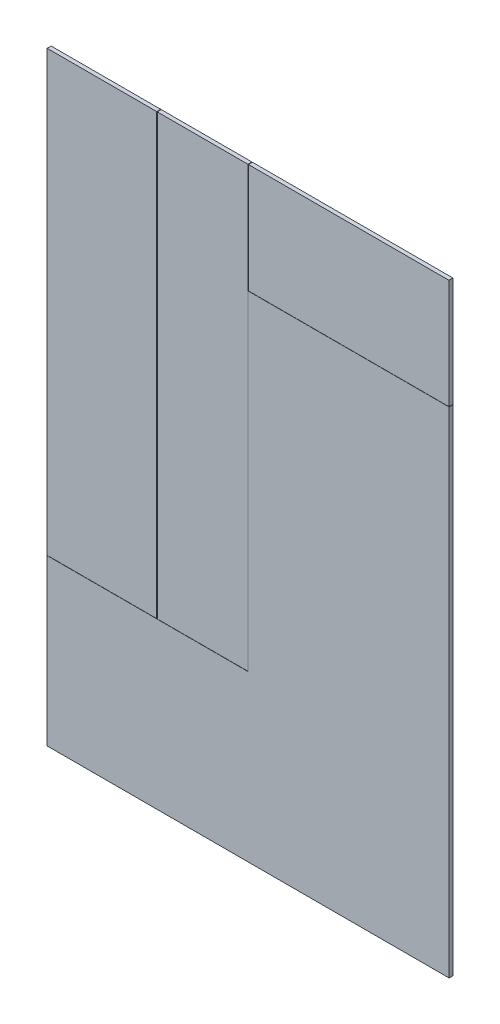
ISO-10303-21;
HEADER;
FILE_DESCRIPTION(('STEP AP214'),'2;1');
FILE_NAME('part.step','',(''),(''),'','','');
FILE_SCHEMA(('AUTOMOTIVE_DESIGN { 1 0 10303 214 1 1 1 1 }'));
ENDSEC;
DATA;
#1=APPLICATION_CONTEXT('core data for automotive mechanical design processes');
#2=APPLICATION_PROTOCOL_DEFINITION('international standard','automotive_design',2000,#1);
#3=PRODUCT_CONTEXT('',#1,'mechanical');
#4=PRODUCT('Part','Part','',(#3));
#5=PRODUCT_RELATED_PRODUCT_CATEGORY('part','',(#4));
#6=PRODUCT_DEFINITION_FORMATION('','',#4);
#7=PRODUCT_DEFINITION_CONTEXT('part definition',#1,'design');
#8=PRODUCT_DEFINITION('design','',#6,#7);
#9=PRODUCT_DEFINITION_SHAPE('','',#8);
#10=(LENGTH_UNIT() NAMED_UNIT(*) SI_UNIT(.MILLI.,.METRE.));
#11=(NAMED_UNIT(*) PLANE_ANGLE_UNIT() SI_UNIT($,.RADIAN.));
#12=(NAMED_UNIT(*) SI_UNIT($,.STERADIAN.) SOLID_ANGLE_UNIT());
#13=UNCERTAINTY_MEASURE_WITH_UNIT(LENGTH_MEASURE(1.E-05),#10,'distance_accuracy_value','');
#14=(GEOMETRIC_REPRESENTATION_CONTEXT(3) GLOBAL_UNCERTAINTY_ASSIGNED_CONTEXT((#13)) GLOBAL_UNIT_ASSIGNED_CONTEXT((#10,
#11,#12)) REPRESENTATION_CONTEXT('',''));
#15=CARTESIAN_POINT('',(0.,0.,0.));
#16=DIRECTION('',(0.,0.,1.));
#17=DIRECTION('',(1.,0.,0.));
#18=AXIS2_PLACEMENT_3D('',#15,#16,#17);
#19=CARTESIAN_POINT('',(0.,2750.,18.));
#20=DIRECTION('',(0.,-1.,0.));
#21=DIRECTION('',(1.,0.,0.));
#22=AXIS2_PLACEMENT_3D('',#19,#20,#21);
#23=PLANE('',#22);
#24=DIRECTION('',(-1.,0.,0.));
#25=VECTOR('',#24,1.);
#26=CARTESIAN_POINT('',(0.,2750.,0.));
#27=LINE('',#26,#25);
#28=CARTESIAN_POINT('',(-1328.99999999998,2750.,0.));
#29=VERTEX_POINT('',#28);
#30=CARTESIAN_POINT('',(-1329.99999999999,2750.,0.));
#31=VERTEX_POINT('',#30);
#32=EDGE_CURVE('E177',#29,#31,#27,.T.);
#33=ORIENTED_EDGE('',*,*,#32,.T.);
#34=DIRECTION('',(0.,0.,1.));
#35=VECTOR('',#34,1.);
#36=CARTESIAN_POINT('',(-1329.99999999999,2750.,0.));
#37=LINE('',#36,#35);
#38=CARTESIAN_POINT('',(-1329.99999999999,2750.,18.));
#39=VERTEX_POINT('',#38);
#40=EDGE_CURVE('E172',#31,#39,#37,.T.);
#41=ORIENTED_EDGE('',*,*,#40,.T.);
#42=DIRECTION('',(-1.,0.,0.));
#43=VECTOR('',#42,1.);
#44=CARTESIAN_POINT('',(0.,2750.,18.));
#45=LINE('',#44,#43);
#46=CARTESIAN_POINT('',(-1328.99999999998,2750.,18.));
#47=VERTEX_POINT('',#46);
#48=EDGE_CURVE('E162',#47,#39,#45,.T.);
#49=ORIENTED_EDGE('',*,*,#48,.F.);
#50=DIRECTION('',(0.,0.,1.));
#51=VECTOR('',#50,1.);
#52=CARTESIAN_POINT('',(-1328.99999999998,2750.,0.));
#53=LINE('',#52,#51);
#54=EDGE_CURVE('E213',#29,#47,#53,.T.);
#55=ORIENTED_EDGE('',*,*,#54,.F.);
#56=EDGE_LOOP('',(#33,#41,#49,#55));
#57=FACE_BOUND('',#56,.T.);
#58=ADVANCED_FACE('F43',(#57),#23,.F.);
#59=CARTESIAN_POINT('',(0.,0.,18.));
#60=DIRECTION('',(-1.,0.,0.));
#61=DIRECTION('',(0.,0.,1.));
#62=AXIS2_PLACEMENT_3D('',#59,#60,#61);
#63=PLANE('',#62);
#64=DIRECTION('',(0.,1.,0.));
#65=VECTOR('',#64,1.);
#66=CARTESIAN_POINT('',(0.,0.,0.));
#67=LINE('',#66,#65);
#68=CARTESIAN_POINT('',(0.,0.,0.));
#69=VERTEX_POINT('',#68);
#70=CARTESIAN_POINT('',(0.,2250.,0.));
#71=VERTEX_POINT('',#70);
#72=EDGE_CURVE('E154',#69,#71,#67,.T.);
#73=ORIENTED_EDGE('',*,*,#72,.T.);
#74=DIRECTION('',(0.,0.,1.));
#75=VECTOR('',#74,1.);
#76=CARTESIAN_POINT('',(0.,2250.,0.));
#77=LINE('',#76,#75);
#78=CARTESIAN_POINT('',(0.,2250.,18.));
#79=VERTEX_POINT('',#78);
#80=EDGE_CURVE('E142',#71,#79,#77,.T.);
#81=ORIENTED_EDGE('',*,*,#80,.T.);
#82=DIRECTION('',(0.,1.,0.));
#83=VECTOR('',#82,1.);
#84=CARTESIAN_POINT('',(0.,0.,18.));
#85=LINE('',#84,#83);
#86=CARTESIAN_POINT('',(0.,0.,18.));
#87=VERTEX_POINT('',#86);
#88=EDGE_CURVE('E152',#87,#79,#85,.T.);
#89=ORIENTED_EDGE('',*,*,#88,.F.);
#90=DIRECTION('',(0.,0.,-1.));
#91=VECTOR('',#90,1.);
#92=CARTESIAN_POINT('',(0.,0.,18.));
#93=LINE('',#92,#91);
#94=EDGE_CURVE('E155',#87,#69,#93,.T.);
#95=ORIENTED_EDGE('',*,*,#94,.T.);
#96=EDGE_LOOP('',(#73,#81,#89,#95));
#97=FACE_BOUND('',#96,.T.);
#98=ADVANCED_FACE('F150',(#97),#63,.F.);
#99=CARTESIAN_POINT('',(-913.999999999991,2750.,18.));
#100=VERTEX_POINT('',#99);
#101=CARTESIAN_POINT('',(-914.999999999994,2750.,18.));
#102=VERTEX_POINT('',#101);
#103=EDGE_CURVE('E160',#100,#102,#45,.T.);
#104=ORIENTED_EDGE('',*,*,#103,.F.);
#105=DIRECTION('',(0.,0.,1.));
#106=VECTOR('',#105,1.);
#107=CARTESIAN_POINT('',(-913.999999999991,2750.,0.));
#108=LINE('',#107,#106);
#109=CARTESIAN_POINT('',(-913.999999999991,2750.,0.));
#110=VERTEX_POINT('',#109);
#111=EDGE_CURVE('E136',#110,#100,#108,.T.);
#112=ORIENTED_EDGE('',*,*,#111,.F.);
#113=CARTESIAN_POINT('',(-914.999999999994,2750.,0.));
#114=VERTEX_POINT('',#113);
#115=EDGE_CURVE('E173',#110,#114,#27,.T.);
#116=ORIENTED_EDGE('',*,*,#115,.T.);
#117=DIRECTION('',(0.,0.,1.));
#118=VECTOR('',#117,1.);
#119=CARTESIAN_POINT('',(-914.999999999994,2750.,0.));
#120=LINE('',#119,#118);
#121=EDGE_CURVE('E176',#114,#102,#120,.T.);
#122=ORIENTED_EDGE('',*,*,#121,.T.);
#123=EDGE_LOOP('',(#104,#112,#116,#122));
#124=FACE_BOUND('',#123,.T.);
#125=ADVANCED_FACE('F230',(#124),#23,.F.);
#126=CARTESIAN_POINT('',(-1830.,-2.24110364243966E-13,18.));
#127=DIRECTION('',(1.,0.,0.));
#128=DIRECTION('',(0.,0.,-1.));
#129=AXIS2_PLACEMENT_3D('',#126,#127,#128);
#130=PLANE('',#129);
#131=DIRECTION('',(0.,-1.,0.));
#132=VECTOR('',#131,1.);
#133=CARTESIAN_POINT('',(-1830.,-2.24110364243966E-13,18.));
#134=LINE('',#133,#132);
#135=CARTESIAN_POINT('',(-1830.,750.,18.));
#136=VERTEX_POINT('',#135);
#137=CARTESIAN_POINT('',(-1830.,-2.24110364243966E-13,18.));
#138=VERTEX_POINT('',#137);
#139=EDGE_CURVE('E164',#136,#138,#134,.T.);
#140=ORIENTED_EDGE('',*,*,#139,.F.);
#141=DIRECTION('',(0.,0.,1.));
#142=VECTOR('',#141,1.);
#143=CARTESIAN_POINT('',(-1830.,750.,0.));
#144=LINE('',#143,#142);
#145=CARTESIAN_POINT('',(-1830.,750.,0.));
#146=VERTEX_POINT('',#145);
#147=EDGE_CURVE('E12',#146,#136,#144,.T.);
#148=ORIENTED_EDGE('',*,*,#147,.F.);
#149=DIRECTION('',(0.,-1.,0.));
#150=VECTOR('',#149,1.);
#151=CARTESIAN_POINT('',(-1830.,-2.24110364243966E-13,0.));
#152=LINE('',#151,#150);
#153=CARTESIAN_POINT('',(-1830.,-2.24110364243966E-13,0.));
#154=VERTEX_POINT('',#153);
#155=EDGE_CURVE('E178',#146,#154,#152,.T.);
#156=ORIENTED_EDGE('',*,*,#155,.T.);
#157=DIRECTION('',(0.,0.,-1.));
#158=VECTOR('',#157,1.);
#159=CARTESIAN_POINT('',(-1830.,-2.24110364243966E-13,18.));
#160=LINE('',#159,#158);
#161=EDGE_CURVE('E169',#138,#154,#160,.T.);
#162=ORIENTED_EDGE('',*,*,#161,.F.);
#163=EDGE_LOOP('',(#140,#148,#156,#162));
#164=FACE_BOUND('',#163,.T.);
#165=ADVANCED_FACE('F267',(#164),#130,.F.);
#166=CARTESIAN_POINT('',(0.,0.,18.));
#167=DIRECTION('',(0.,1.,0.));
#168=DIRECTION('',(-1.,0.,0.));
#169=AXIS2_PLACEMENT_3D('',#166,#167,#168);
#170=PLANE('',#169);
#171=DIRECTION('',(1.,0.,0.));
#172=VECTOR('',#171,1.);
#173=CARTESIAN_POINT('',(0.,0.,0.));
#174=LINE('',#173,#172);
#175=EDGE_CURVE('E180',#154,#69,#174,.T.);
#176=ORIENTED_EDGE('',*,*,#175,.T.);
#177=ORIENTED_EDGE('',*,*,#94,.F.);
#178=DIRECTION('',(1.,0.,0.));
#179=VECTOR('',#178,1.);
#180=CARTESIAN_POINT('',(0.,0.,18.));
#181=LINE('',#180,#179);
#182=EDGE_CURVE('E158',#138,#87,#181,.T.);
#183=ORIENTED_EDGE('',*,*,#182,.F.);
#184=ORIENTED_EDGE('',*,*,#161,.T.);
#185=EDGE_LOOP('',(#176,#177,#183,#184));
#186=FACE_BOUND('',#185,.T.);
#187=ADVANCED_FACE('F271',(#186),#170,.F.);
#188=CARTESIAN_POINT('',(0.,0.,18.));
#189=DIRECTION('',(0.,0.,1.));
#190=DIRECTION('',(1.,0.,0.));
#191=AXIS2_PLACEMENT_3D('',#188,#189,#190);
#192=PLANE('',#191);
#193=DIRECTION('',(0.,1.,0.));
#194=VECTOR('',#193,1.);
#195=CARTESIAN_POINT('',(-1329.99999999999,2750.,18.));
#196=LINE('',#195,#194);
#197=CARTESIAN_POINT('',(-1329.99999999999,750.,18.));
#198=VERTEX_POINT('',#197);
#199=EDGE_CURVE('E73',#198,#39,#196,.T.);
#200=ORIENTED_EDGE('',*,*,#199,.F.);
#201=DIRECTION('',(1.,0.,0.));
#202=VECTOR('',#201,1.);
#203=CARTESIAN_POINT('',(-1830.,750.,18.));
#204=LINE('',#203,#202);
#205=EDGE_CURVE('E53',#136,#198,#204,.T.);
#206=ORIENTED_EDGE('',*,*,#205,.F.);
#207=ORIENTED_EDGE('',*,*,#139,.T.);
#208=ORIENTED_EDGE('',*,*,#182,.T.);
#209=ORIENTED_EDGE('',*,*,#88,.T.);
#210=DIRECTION('',(1.,0.,0.));
#211=VECTOR('',#210,1.);
#212=CARTESIAN_POINT('',(-913.999999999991,2250.,18.));
#213=LINE('',#212,#211);
#214=CARTESIAN_POINT('',(-913.999999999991,2250.,18.));
#215=VERTEX_POINT('',#214);
#216=EDGE_CURVE('E139',#215,#79,#213,.T.);
#217=ORIENTED_EDGE('',*,*,#216,.F.);
#218=DIRECTION('',(0.,-1.,0.));
#219=VECTOR('',#218,1.);
#220=CARTESIAN_POINT('',(-913.999999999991,2750.,18.));
#221=LINE('',#220,#219);
#222=EDGE_CURVE('E186',#100,#215,#221,.T.);
#223=ORIENTED_EDGE('',*,*,#222,.F.);
#224=ORIENTED_EDGE('',*,*,#103,.T.);
#225=DIRECTION('',(0.,1.,0.));
#226=VECTOR('',#225,1.);
#227=CARTESIAN_POINT('',(-914.999999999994,2750.,18.));
#228=LINE('',#227,#226);
#229=CARTESIAN_POINT('',(-914.999999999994,750.,18.));
#230=VERTEX_POINT('',#229);
#231=EDGE_CURVE('E237',#230,#102,#228,.T.);
#232=ORIENTED_EDGE('',*,*,#231,.F.);
#233=DIRECTION('',(1.,0.,0.));
#234=VECTOR('',#233,1.);
#235=CARTESIAN_POINT('',(-1328.99999999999,750.,18.));
#236=LINE('',#235,#234);
#237=CARTESIAN_POINT('',(-1328.99999999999,750.,18.));
#238=VERTEX_POINT('',#237);
#239=EDGE_CURVE('E245',#238,#230,#236,.T.);
#240=ORIENTED_EDGE('',*,*,#239,.F.);
#241=DIRECTION('',(0.,-1.,0.));
#242=VECTOR('',#241,1.);
#243=CARTESIAN_POINT('',(-1328.99999999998,2750.,18.));
#244=LINE('',#243,#242);
#245=EDGE_CURVE('E191',#47,#238,#244,.T.);
#246=ORIENTED_EDGE('',*,*,#245,.F.);
#247=ORIENTED_EDGE('',*,*,#48,.T.);
#248=EDGE_LOOP('',(#200,#206,#207,#208,#209,#217,#223,#224,#232,#240,#246,#247));
#249=FACE_BOUND('',#248,.T.);
#250=ADVANCED_FACE('F45',(#249),#192,.T.);
#251=CARTESIAN_POINT('',(0.,0.,0.));
#252=DIRECTION('',(0.,0.,1.));
#253=DIRECTION('',(1.,0.,0.));
#254=AXIS2_PLACEMENT_3D('',#251,#252,#253);
#255=PLANE('',#254);
#256=DIRECTION('',(1.,0.,0.));
#257=VECTOR('',#256,1.);
#258=CARTESIAN_POINT('',(-1830.,750.,0.));
#259=LINE('',#258,#257);
#260=CARTESIAN_POINT('',(-1329.99999999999,750.,0.));
#261=VERTEX_POINT('',#260);
#262=EDGE_CURVE('E200',#146,#261,#259,.T.);
#263=ORIENTED_EDGE('',*,*,#262,.T.);
#264=DIRECTION('',(0.,1.,0.));
#265=VECTOR('',#264,1.);
#266=CARTESIAN_POINT('',(-1329.99999999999,2750.,0.));
#267=LINE('',#266,#265);
#268=EDGE_CURVE('E47',#261,#31,#267,.T.);
#269=ORIENTED_EDGE('',*,*,#268,.T.);
#270=ORIENTED_EDGE('',*,*,#32,.F.);
#271=DIRECTION('',(0.,-1.,0.));
#272=VECTOR('',#271,1.);
#273=CARTESIAN_POINT('',(-1328.99999999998,2750.,0.));
#274=LINE('',#273,#272);
#275=CARTESIAN_POINT('',(-1328.99999999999,750.,0.));
#276=VERTEX_POINT('',#275);
#277=EDGE_CURVE('E205',#29,#276,#274,.T.);
#278=ORIENTED_EDGE('',*,*,#277,.T.);
#279=DIRECTION('',(1.,0.,0.));
#280=VECTOR('',#279,1.);
#281=CARTESIAN_POINT('',(-1328.99999999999,750.,0.));
#282=LINE('',#281,#280);
#283=CARTESIAN_POINT('',(-914.999999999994,750.,0.));
#284=VERTEX_POINT('',#283);
#285=EDGE_CURVE('E239',#276,#284,#282,.T.);
#286=ORIENTED_EDGE('',*,*,#285,.T.);
#287=DIRECTION('',(0.,1.,0.));
#288=VECTOR('',#287,1.);
#289=CARTESIAN_POINT('',(-914.999999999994,2750.,0.));
#290=LINE('',#289,#288);
#291=EDGE_CURVE('E195',#284,#114,#290,.T.);
#292=ORIENTED_EDGE('',*,*,#291,.T.);
#293=ORIENTED_EDGE('',*,*,#115,.F.);
#294=DIRECTION('',(0.,-1.,0.));
#295=VECTOR('',#294,1.);
#296=CARTESIAN_POINT('',(-913.999999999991,2750.,0.));
#297=LINE('',#296,#295);
#298=CARTESIAN_POINT('',(-913.999999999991,2250.,0.));
#299=VERTEX_POINT('',#298);
#300=EDGE_CURVE('E192',#110,#299,#297,.T.);
#301=ORIENTED_EDGE('',*,*,#300,.T.);
#302=DIRECTION('',(1.,0.,0.));
#303=VECTOR('',#302,1.);
#304=CARTESIAN_POINT('',(-913.999999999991,2250.,0.));
#305=LINE('',#304,#303);
#306=EDGE_CURVE('E189',#299,#71,#305,.T.);
#307=ORIENTED_EDGE('',*,*,#306,.T.);
#308=ORIENTED_EDGE('',*,*,#72,.F.);
#309=ORIENTED_EDGE('',*,*,#175,.F.);
#310=ORIENTED_EDGE('',*,*,#155,.F.);
#311=EDGE_LOOP('',(#263,#269,#270,#278,#286,#292,#293,#301,#307,#308,#309,#310));
#312=FACE_BOUND('',#311,.T.);
#313=ADVANCED_FACE('F218',(#312),#255,.F.);
#314=CARTESIAN_POINT('',(-1328.99999999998,2750.,0.));
#315=DIRECTION('',(-1.,0.,0.));
#316=DIRECTION('',(0.,-1.,0.));
#317=AXIS2_PLACEMENT_3D('',#314,#315,#316);
#318=PLANE('',#317);
#319=ORIENTED_EDGE('',*,*,#245,.T.);
#320=DIRECTION('',(0.,0.,1.));
#321=VECTOR('',#320,1.);
#322=CARTESIAN_POINT('',(-1328.99999999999,750.,0.));
#323=LINE('',#322,#321);
#324=EDGE_CURVE('E104',#276,#238,#323,.T.);
#325=ORIENTED_EDGE('',*,*,#324,.F.);
#326=ORIENTED_EDGE('',*,*,#277,.F.);
#327=ORIENTED_EDGE('',*,*,#54,.T.);
#328=EDGE_LOOP('',(#319,#325,#326,#327));
#329=FACE_BOUND('',#328,.T.);
#330=ADVANCED_FACE('F280',(#329),#318,.F.);
#331=CARTESIAN_POINT('',(-914.999999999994,2750.,0.));
#332=DIRECTION('',(1.,0.,0.));
#333=DIRECTION('',(0.,0.,-1.));
#334=AXIS2_PLACEMENT_3D('',#331,#332,#333);
#335=PLANE('',#334);
#336=ORIENTED_EDGE('',*,*,#231,.T.);
#337=ORIENTED_EDGE('',*,*,#121,.F.);
#338=ORIENTED_EDGE('',*,*,#291,.F.);
#339=DIRECTION('',(0.,0.,1.));
#340=VECTOR('',#339,1.);
#341=CARTESIAN_POINT('',(-914.999999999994,750.,0.));
#342=LINE('',#341,#340);
#343=EDGE_CURVE('E247',#284,#230,#342,.T.);
#344=ORIENTED_EDGE('',*,*,#343,.T.);
#345=EDGE_LOOP('',(#336,#337,#338,#344));
#346=FACE_BOUND('',#345,.T.);
#347=ADVANCED_FACE('F234',(#346),#335,.F.);
#348=CARTESIAN_POINT('',(-1328.99999999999,750.,0.));
#349=DIRECTION('',(0.,-1.,0.));
#350=DIRECTION('',(0.,0.,-1.));
#351=AXIS2_PLACEMENT_3D('',#348,#349,#350);
#352=PLANE('',#351);
#353=ORIENTED_EDGE('',*,*,#239,.T.);
#354=ORIENTED_EDGE('',*,*,#343,.F.);
#355=ORIENTED_EDGE('',*,*,#285,.F.);
#356=ORIENTED_EDGE('',*,*,#324,.T.);
#357=EDGE_LOOP('',(#353,#354,#355,#356));
#358=FACE_BOUND('',#357,.T.);
#359=ADVANCED_FACE('F249',(#358),#352,.F.);
#360=CARTESIAN_POINT('',(-913.999999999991,2750.,0.));
#361=DIRECTION('',(-1.,0.,0.));
#362=DIRECTION('',(0.,0.,1.));
#363=AXIS2_PLACEMENT_3D('',#360,#361,#362);
#364=PLANE('',#363);
#365=ORIENTED_EDGE('',*,*,#222,.T.);
#366=DIRECTION('',(0.,0.,1.));
#367=VECTOR('',#366,1.);
#368=CARTESIAN_POINT('',(-913.999999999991,2250.,0.));
#369=LINE('',#368,#367);
#370=EDGE_CURVE('E83',#299,#215,#369,.T.);
#371=ORIENTED_EDGE('',*,*,#370,.F.);
#372=ORIENTED_EDGE('',*,*,#300,.F.);
#373=ORIENTED_EDGE('',*,*,#111,.T.);
#374=EDGE_LOOP('',(#365,#371,#372,#373));
#375=FACE_BOUND('',#374,.T.);
#376=ADVANCED_FACE('F250',(#375),#364,.F.);
#377=CARTESIAN_POINT('',(-913.999999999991,2250.,0.));
#378=DIRECTION('',(0.,-1.,0.));
#379=DIRECTION('',(0.,0.,-1.));
#380=AXIS2_PLACEMENT_3D('',#377,#378,#379);
#381=PLANE('',#380);
#382=ORIENTED_EDGE('',*,*,#216,.T.);
#383=ORIENTED_EDGE('',*,*,#80,.F.);
#384=ORIENTED_EDGE('',*,*,#306,.F.);
#385=ORIENTED_EDGE('',*,*,#370,.T.);
#386=EDGE_LOOP('',(#382,#383,#384,#385));
#387=FACE_BOUND('',#386,.T.);
#388=ADVANCED_FACE('F141',(#387),#381,.F.);
#389=CARTESIAN_POINT('',(-1329.99999999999,2750.,0.));
#390=DIRECTION('',(1.,0.,0.));
#391=DIRECTION('',(0.,0.,-1.));
#392=AXIS2_PLACEMENT_3D('',#389,#390,#391);
#393=PLANE('',#392);
#394=ORIENTED_EDGE('',*,*,#199,.T.);
#395=ORIENTED_EDGE('',*,*,#40,.F.);
#396=ORIENTED_EDGE('',*,*,#268,.F.);
#397=DIRECTION('',(0.,0.,1.));
#398=VECTOR('',#397,1.);
#399=CARTESIAN_POINT('',(-1329.99999999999,750.,0.));
#400=LINE('',#399,#398);
#401=EDGE_CURVE('E197',#261,#198,#400,.T.);
#402=ORIENTED_EDGE('',*,*,#401,.T.);
#403=EDGE_LOOP('',(#394,#395,#396,#402));
#404=FACE_BOUND('',#403,.T.);
#405=ADVANCED_FACE('F216',(#404),#393,.F.);
#406=CARTESIAN_POINT('',(-1830.,750.,0.));
#407=DIRECTION('',(0.,-1.,0.));
#408=DIRECTION('',(0.,0.,-1.));
#409=AXIS2_PLACEMENT_3D('',#406,#407,#408);
#410=PLANE('',#409);
#411=ORIENTED_EDGE('',*,*,#205,.T.);
#412=ORIENTED_EDGE('',*,*,#401,.F.);
#413=ORIENTED_EDGE('',*,*,#262,.F.);
#414=ORIENTED_EDGE('',*,*,#147,.T.);
#415=EDGE_LOOP('',(#411,#412,#413,#414));
#416=FACE_BOUND('',#415,.T.);
#417=ADVANCED_FACE('F312',(#416),#410,.F.);
#418=CLOSED_SHELL('',(#58,#98,#125,#165,#187,#250,#313,#330,#347,#359,#376,#388,#405,#417));
#419=MANIFOLD_SOLID_BREP('B2',#418);
#420=CARTESIAN_POINT('',(0.,0.,0.));
#421=DIRECTION('',(0.,0.,1.));
#422=DIRECTION('',(1.,0.,0.));
#423=AXIS2_PLACEMENT_3D('',#420,#421,#422);
#424=PLANE('',#423);
#425=DIRECTION('',(0.,1.,0.));
#426=VECTOR('',#425,1.);
#427=CARTESIAN_POINT('',(-0.999999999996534,2251.,0.));
#428=LINE('',#427,#426);
#429=CARTESIAN_POINT('',(-0.999999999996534,2251.,0.));
#430=VERTEX_POINT('',#429);
#431=CARTESIAN_POINT('',(-0.999999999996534,2749.,0.));
#432=VERTEX_POINT('',#431);
#433=EDGE_CURVE('E385',#430,#432,#428,.T.);
#434=ORIENTED_EDGE('',*,*,#433,.F.);
#435=DIRECTION('',(1.,0.,0.));
#436=VECTOR('',#435,1.);
#437=CARTESIAN_POINT('',(-0.999999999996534,2251.,0.));
#438=LINE('',#437,#436);
#439=CARTESIAN_POINT('',(-912.999999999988,2251.,0.));
#440=VERTEX_POINT('',#439);
#441=EDGE_CURVE('E422',#440,#430,#438,.T.);
#442=ORIENTED_EDGE('',*,*,#441,.F.);
#443=DIRECTION('',(0.,-1.,0.));
#444=VECTOR('',#443,1.);
#445=CARTESIAN_POINT('',(-912.999999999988,2251.,0.));
#446=LINE('',#445,#444);
#447=CARTESIAN_POINT('',(-912.999999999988,2749.,0.));
#448=VERTEX_POINT('',#447);
#449=EDGE_CURVE('E442',#448,#440,#446,.T.);
#450=ORIENTED_EDGE('',*,*,#449,.F.);
#451=DIRECTION('',(-1.,0.,0.));
#452=VECTOR('',#451,1.);
#453=CARTESIAN_POINT('',(-0.999999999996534,2749.,0.));
#454=LINE('',#453,#452);
#455=EDGE_CURVE('E434',#432,#448,#454,.T.);
#456=ORIENTED_EDGE('',*,*,#455,.F.);
#457=EDGE_LOOP('',(#434,#442,#450,#456));
#458=FACE_BOUND('',#457,.T.);
#459=ADVANCED_FACE('F381',(#458),#424,.F.);
#460=CARTESIAN_POINT('',(-0.999999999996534,2749.,0.));
#461=DIRECTION('',(0.,1.,0.));
#462=DIRECTION('',(0.,0.,1.));
#463=AXIS2_PLACEMENT_3D('',#460,#461,#462);
#464=PLANE('',#463);
#465=DIRECTION('',(-1.,0.,0.));
#466=VECTOR('',#465,1.);
#467=CARTESIAN_POINT('',(-0.999999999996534,2749.,18.));
#468=LINE('',#467,#466);
#469=CARTESIAN_POINT('',(-0.999999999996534,2749.,18.));
#470=VERTEX_POINT('',#469);
#471=CARTESIAN_POINT('',(-912.999999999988,2749.,18.));
#472=VERTEX_POINT('',#471);
#473=EDGE_CURVE('E391',#470,#472,#468,.T.);
#474=ORIENTED_EDGE('',*,*,#473,.F.);
#475=DIRECTION('',(0.,0.,1.));
#476=VECTOR('',#475,1.);
#477=CARTESIAN_POINT('',(-0.999999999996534,2749.,0.));
#478=LINE('',#477,#476);
#479=EDGE_CURVE('E400',#432,#470,#478,.T.);
#480=ORIENTED_EDGE('',*,*,#479,.F.);
#481=ORIENTED_EDGE('',*,*,#455,.T.);
#482=DIRECTION('',(0.,0.,1.));
#483=VECTOR('',#482,1.);
#484=CARTESIAN_POINT('',(-912.999999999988,2749.,0.));
#485=LINE('',#484,#483);
#486=EDGE_CURVE('E439',#448,#472,#485,.T.);
#487=ORIENTED_EDGE('',*,*,#486,.T.);
#488=EDGE_LOOP('',(#474,#480,#481,#487));
#489=FACE_BOUND('',#488,.T.);
#490=ADVANCED_FACE('F448',(#489),#464,.T.);
#491=CARTESIAN_POINT('',(-912.999999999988,2251.,0.));
#492=DIRECTION('',(-1.,0.,0.));
#493=DIRECTION('',(0.,0.,1.));
#494=AXIS2_PLACEMENT_3D('',#491,#492,#493);
#495=PLANE('',#494);
#496=DIRECTION('',(0.,-1.,0.));
#497=VECTOR('',#496,1.);
#498=CARTESIAN_POINT('',(-912.999999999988,2251.,18.));
#499=LINE('',#498,#497);
#500=CARTESIAN_POINT('',(-912.999999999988,2251.,18.));
#501=VERTEX_POINT('',#500);
#502=EDGE_CURVE('E41',#472,#501,#499,.T.);
#503=ORIENTED_EDGE('',*,*,#502,.F.);
#504=ORIENTED_EDGE('',*,*,#486,.F.);
#505=ORIENTED_EDGE('',*,*,#449,.T.);
#506=DIRECTION('',(0.,0.,1.));
#507=VECTOR('',#506,1.);
#508=CARTESIAN_POINT('',(-912.999999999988,2251.,0.));
#509=LINE('',#508,#507);
#510=EDGE_CURVE('E427',#440,#501,#509,.T.);
#511=ORIENTED_EDGE('',*,*,#510,.T.);
#512=EDGE_LOOP('',(#503,#504,#505,#511));
#513=FACE_BOUND('',#512,.T.);
#514=ADVANCED_FACE('F453',(#513),#495,.T.);
#515=CARTESIAN_POINT('',(-0.999999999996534,2251.,0.));
#516=DIRECTION('',(0.,-1.,0.));
#517=DIRECTION('',(0.,0.,-1.));
#518=AXIS2_PLACEMENT_3D('',#515,#516,#517);
#519=PLANE('',#518);
#520=DIRECTION('',(1.,0.,0.));
#521=VECTOR('',#520,1.);
#522=CARTESIAN_POINT('',(-0.999999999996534,2251.,18.));
#523=LINE('',#522,#521);
#524=CARTESIAN_POINT('',(-0.999999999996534,2251.,18.));
#525=VERTEX_POINT('',#524);
#526=EDGE_CURVE('E435',#501,#525,#523,.T.);
#527=ORIENTED_EDGE('',*,*,#526,.F.);
#528=ORIENTED_EDGE('',*,*,#510,.F.);
#529=ORIENTED_EDGE('',*,*,#441,.T.);
#530=DIRECTION('',(0.,0.,1.));
#531=VECTOR('',#530,1.);
#532=CARTESIAN_POINT('',(-0.999999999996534,2251.,0.));
#533=LINE('',#532,#531);
#534=EDGE_CURVE('E413',#430,#525,#533,.T.);
#535=ORIENTED_EDGE('',*,*,#534,.T.);
#536=EDGE_LOOP('',(#527,#528,#529,#535));
#537=FACE_BOUND('',#536,.T.);
#538=ADVANCED_FACE('F426',(#537),#519,.T.);
#539=CARTESIAN_POINT('',(-0.999999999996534,2251.,0.));
#540=DIRECTION('',(1.,0.,0.));
#541=DIRECTION('',(0.,0.,-1.));
#542=AXIS2_PLACEMENT_3D('',#539,#540,#541);
#543=PLANE('',#542);
#544=DIRECTION('',(0.,1.,0.));
#545=VECTOR('',#544,1.);
#546=CARTESIAN_POINT('',(-0.999999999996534,2251.,18.));
#547=LINE('',#546,#545);
#548=EDGE_CURVE('E418',#525,#470,#547,.T.);
#549=ORIENTED_EDGE('',*,*,#548,.F.);
#550=ORIENTED_EDGE('',*,*,#534,.F.);
#551=ORIENTED_EDGE('',*,*,#433,.T.);
#552=ORIENTED_EDGE('',*,*,#479,.T.);
#553=EDGE_LOOP('',(#549,#550,#551,#552));
#554=FACE_BOUND('',#553,.T.);
#555=ADVANCED_FACE('F415',(#554),#543,.T.);
#556=CARTESIAN_POINT('',(0.,0.,18.));
#557=DIRECTION('',(0.,0.,1.));
#558=DIRECTION('',(1.,0.,0.));
#559=AXIS2_PLACEMENT_3D('',#556,#557,#558);
#560=PLANE('',#559);
#561=ORIENTED_EDGE('',*,*,#526,.T.);
#562=ORIENTED_EDGE('',*,*,#548,.T.);
#563=ORIENTED_EDGE('',*,*,#473,.T.);
#564=ORIENTED_EDGE('',*,*,#502,.T.);
#565=EDGE_LOOP('',(#561,#562,#563,#564));
#566=FACE_BOUND('',#565,.T.);
#567=ADVANCED_FACE('F383',(#566),#560,.T.);
#568=CLOSED_SHELL('',(#459,#490,#514,#538,#555,#567));
#569=MANIFOLD_SOLID_BREP('B6',#568);
#570=CARTESIAN_POINT('',(0.,0.,0.));
#571=DIRECTION('',(0.,0.,1.));
#572=DIRECTION('',(1.,0.,0.));
#573=AXIS2_PLACEMENT_3D('',#570,#571,#572);
#574=PLANE('',#573);
#575=DIRECTION('',(0.,-1.,0.));
#576=VECTOR('',#575,1.);
#577=CARTESIAN_POINT('',(-1829.,2749.,0.));
#578=LINE('',#577,#576);
#579=CARTESIAN_POINT('',(-1829.,2749.,0.));
#580=VERTEX_POINT('',#579);
#581=CARTESIAN_POINT('',(-1829.,751.,0.));
#582=VERTEX_POINT('',#581);
#583=EDGE_CURVE('E538',#580,#582,#578,.T.);
#584=ORIENTED_EDGE('',*,*,#583,.F.);
#585=DIRECTION('',(-1.,0.,0.));
#586=VECTOR('',#585,1.);
#587=CARTESIAN_POINT('',(-1829.,2749.,0.));
#588=LINE('',#587,#586);
#589=CARTESIAN_POINT('',(-1330.99999999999,2749.,0.));
#590=VERTEX_POINT('',#589);
#591=EDGE_CURVE('E558',#590,#580,#588,.T.);
#592=ORIENTED_EDGE('',*,*,#591,.F.);
#593=DIRECTION('',(0.,1.,0.));
#594=VECTOR('',#593,1.);
#595=CARTESIAN_POINT('',(-1330.99999999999,2749.,0.));
#596=LINE('',#595,#594);
#597=CARTESIAN_POINT('',(-1330.99999999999,751.,0.));
#598=VERTEX_POINT('',#597);
#599=EDGE_CURVE('E564',#598,#590,#596,.T.);
#600=ORIENTED_EDGE('',*,*,#599,.F.);
#601=DIRECTION('',(1.,0.,0.));
#602=VECTOR('',#601,1.);
#603=CARTESIAN_POINT('',(-1829.,751.,0.));
#604=LINE('',#603,#602);
#605=EDGE_CURVE('E569',#582,#598,#604,.T.);
#606=ORIENTED_EDGE('',*,*,#605,.F.);
#607=EDGE_LOOP('',(#584,#592,#600,#606));
#608=FACE_BOUND('',#607,.T.);
#609=ADVANCED_FACE('F513',(#608),#574,.F.);
#610=CARTESIAN_POINT('',(-1829.,751.,0.));
#611=DIRECTION('',(0.,-1.,0.));
#612=DIRECTION('',(1.,0.,0.));
#613=AXIS2_PLACEMENT_3D('',#610,#611,#612);
#614=PLANE('',#613);
#615=DIRECTION('',(1.,0.,0.));
#616=VECTOR('',#615,1.);
#617=CARTESIAN_POINT('',(-1829.,751.,18.));
#618=LINE('',#617,#616);
#619=CARTESIAN_POINT('',(-1829.,751.,18.));
#620=VERTEX_POINT('',#619);
#621=CARTESIAN_POINT('',(-1330.99999999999,751.,18.));
#622=VERTEX_POINT('',#621);
#623=EDGE_CURVE('E577',#620,#622,#618,.T.);
#624=ORIENTED_EDGE('',*,*,#623,.F.);
#625=DIRECTION('',(0.,0.,1.));
#626=VECTOR('',#625,1.);
#627=CARTESIAN_POINT('',(-1829.,751.,0.));
#628=LINE('',#627,#626);
#629=EDGE_CURVE('E517',#582,#620,#628,.T.);
#630=ORIENTED_EDGE('',*,*,#629,.F.);
#631=ORIENTED_EDGE('',*,*,#605,.T.);
#632=DIRECTION('',(0.,0.,1.));
#633=VECTOR('',#632,1.);
#634=CARTESIAN_POINT('',(-1330.99999999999,751.,0.));
#635=LINE('',#634,#633);
#636=EDGE_CURVE('E561',#598,#622,#635,.T.);
#637=ORIENTED_EDGE('',*,*,#636,.T.);
#638=EDGE_LOOP('',(#624,#630,#631,#637));
#639=FACE_BOUND('',#638,.T.);
#640=ADVANCED_FACE('F583',(#639),#614,.T.);
#641=CARTESIAN_POINT('',(-1330.99999999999,2749.,0.));
#642=DIRECTION('',(1.,0.,0.));
#643=DIRECTION('',(0.,0.,-1.));
#644=AXIS2_PLACEMENT_3D('',#641,#642,#643);
#645=PLANE('',#644);
#646=DIRECTION('',(0.,1.,0.));
#647=VECTOR('',#646,1.);
#648=CARTESIAN_POINT('',(-1330.99999999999,2749.,18.));
#649=LINE('',#648,#647);
#650=CARTESIAN_POINT('',(-1330.99999999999,2749.,18.));
#651=VERTEX_POINT('',#650);
#652=EDGE_CURVE('E530',#622,#651,#649,.T.);
#653=ORIENTED_EDGE('',*,*,#652,.F.);
#654=ORIENTED_EDGE('',*,*,#636,.F.);
#655=ORIENTED_EDGE('',*,*,#599,.T.);
#656=DIRECTION('',(0.,0.,1.));
#657=VECTOR('',#656,1.);
#658=CARTESIAN_POINT('',(-1330.99999999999,2749.,0.));
#659=LINE('',#658,#657);
#660=EDGE_CURVE('E522',#590,#651,#659,.T.);
#661=ORIENTED_EDGE('',*,*,#660,.T.);
#662=EDGE_LOOP('',(#653,#654,#655,#661));
#663=FACE_BOUND('',#662,.T.);
#664=ADVANCED_FACE('F565',(#663),#645,.T.);
#665=CARTESIAN_POINT('',(-1829.,2749.,0.));
#666=DIRECTION('',(0.,1.,0.));
#667=DIRECTION('',(0.,0.,1.));
#668=AXIS2_PLACEMENT_3D('',#665,#666,#667);
#669=PLANE('',#668);
#670=DIRECTION('',(-1.,0.,0.));
#671=VECTOR('',#670,1.);
#672=CARTESIAN_POINT('',(-1829.,2749.,18.));
#673=LINE('',#672,#671);
#674=CARTESIAN_POINT('',(-1829.,2749.,18.));
#675=VERTEX_POINT('',#674);
#676=EDGE_CURVE('E560',#651,#675,#673,.T.);
#677=ORIENTED_EDGE('',*,*,#676,.F.);
#678=ORIENTED_EDGE('',*,*,#660,.F.);
#679=ORIENTED_EDGE('',*,*,#591,.T.);
#680=DIRECTION('',(0.,0.,1.));
#681=VECTOR('',#680,1.);
#682=CARTESIAN_POINT('',(-1829.,2749.,0.));
#683=LINE('',#682,#681);
#684=EDGE_CURVE('E379',#580,#675,#683,.T.);
#685=ORIENTED_EDGE('',*,*,#684,.T.);
#686=EDGE_LOOP('',(#677,#678,#679,#685));
#687=FACE_BOUND('',#686,.T.);
#688=ADVANCED_FACE('F556',(#687),#669,.T.);
#689=CARTESIAN_POINT('',(-1829.,2749.,0.));
#690=DIRECTION('',(-1.,0.,0.));
#691=DIRECTION('',(0.,0.,1.));
#692=AXIS2_PLACEMENT_3D('',#689,#690,#691);
#693=PLANE('',#692);
#694=DIRECTION('',(0.,-1.,0.));
#695=VECTOR('',#694,1.);
#696=CARTESIAN_POINT('',(-1829.,2749.,18.));
#697=LINE('',#696,#695);
#698=EDGE_CURVE('E574',#675,#620,#697,.T.);
#699=ORIENTED_EDGE('',*,*,#698,.F.);
#700=ORIENTED_EDGE('',*,*,#684,.F.);
#701=ORIENTED_EDGE('',*,*,#583,.T.);
#702=ORIENTED_EDGE('',*,*,#629,.T.);
#703=EDGE_LOOP('',(#699,#700,#701,#702));
#704=FACE_BOUND('',#703,.T.);
#705=ADVANCED_FACE('F586',(#704),#693,.T.);
#706=CARTESIAN_POINT('',(0.,0.,18.));
#707=DIRECTION('',(0.,0.,1.));
#708=DIRECTION('',(1.,0.,0.));
#709=AXIS2_PLACEMENT_3D('',#706,#707,#708);
#710=PLANE('',#709);
#711=ORIENTED_EDGE('',*,*,#676,.T.);
#712=ORIENTED_EDGE('',*,*,#698,.T.);
#713=ORIENTED_EDGE('',*,*,#623,.T.);
#714=ORIENTED_EDGE('',*,*,#652,.T.);
#715=EDGE_LOOP('',(#711,#712,#713,#714));
#716=FACE_BOUND('',#715,.T.);
#717=ADVANCED_FACE('F515',(#716),#710,.T.);
#718=CLOSED_SHELL('',(#609,#640,#664,#688,#705,#717));
#719=MANIFOLD_SOLID_BREP('B35',#718);
#720=CARTESIAN_POINT('',(0.,0.,0.));
#721=DIRECTION('',(0.,0.,1.));
#722=DIRECTION('',(1.,0.,0.));
#723=AXIS2_PLACEMENT_3D('',#720,#721,#722);
#724=PLANE('',#723);
#725=DIRECTION('',(0.,-1.,0.));
#726=VECTOR('',#725,1.);
#727=CARTESIAN_POINT('',(-1327.99999999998,2749.,0.));
#728=LINE('',#727,#726);
#729=CARTESIAN_POINT('',(-1327.99999999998,2749.,0.));
#730=VERTEX_POINT('',#729);
#731=CARTESIAN_POINT('',(-1327.99999999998,751.,0.));
#732=VERTEX_POINT('',#731);
#733=EDGE_CURVE('E660',#730,#732,#728,.T.);
#734=ORIENTED_EDGE('',*,*,#733,.F.);
#735=DIRECTION('',(-1.,0.,0.));
#736=VECTOR('',#735,1.);
#737=CARTESIAN_POINT('',(-1327.99999999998,2749.,0.));
#738=LINE('',#737,#736);
#739=CARTESIAN_POINT('',(-915.999999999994,2749.,0.));
#740=VERTEX_POINT('',#739);
#741=EDGE_CURVE('E680',#740,#730,#738,.T.);
#742=ORIENTED_EDGE('',*,*,#741,.F.);
#743=DIRECTION('',(0.,1.,0.));
#744=VECTOR('',#743,1.);
#745=CARTESIAN_POINT('',(-915.999999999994,2749.,0.));
#746=LINE('',#745,#744);
#747=CARTESIAN_POINT('',(-915.999999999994,751.,0.));
#748=VERTEX_POINT('',#747);
#749=EDGE_CURVE('E686',#748,#740,#746,.T.);
#750=ORIENTED_EDGE('',*,*,#749,.F.);
#751=DIRECTION('',(1.,0.,0.));
#752=VECTOR('',#751,1.);
#753=CARTESIAN_POINT('',(-1327.99999999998,751.,0.));
#754=LINE('',#753,#752);
#755=EDGE_CURVE('E691',#732,#748,#754,.T.);
#756=ORIENTED_EDGE('',*,*,#755,.F.);
#757=EDGE_LOOP('',(#734,#742,#750,#756));
#758=FACE_BOUND('',#757,.T.);
#759=ADVANCED_FACE('F636',(#758),#724,.F.);
#760=CARTESIAN_POINT('',(-1327.99999999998,751.,0.));
#761=DIRECTION('',(0.,-1.,0.));
#762=DIRECTION('',(1.,0.,0.));
#763=AXIS2_PLACEMENT_3D('',#760,#761,#762);
#764=PLANE('',#763);
#765=DIRECTION('',(1.,0.,0.));
#766=VECTOR('',#765,1.);
#767=CARTESIAN_POINT('',(-1327.99999999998,751.,18.));
#768=LINE('',#767,#766);
#769=CARTESIAN_POINT('',(-1327.99999999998,751.,18.));
#770=VERTEX_POINT('',#769);
#771=CARTESIAN_POINT('',(-915.999999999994,751.,18.));
#772=VERTEX_POINT('',#771);
#773=EDGE_CURVE('E699',#770,#772,#768,.T.);
#774=ORIENTED_EDGE('',*,*,#773,.F.);
#775=DIRECTION('',(0.,0.,1.));
#776=VECTOR('',#775,1.);
#777=CARTESIAN_POINT('',(-1327.99999999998,751.,0.));
#778=LINE('',#777,#776);
#779=EDGE_CURVE('E639',#732,#770,#778,.T.);
#780=ORIENTED_EDGE('',*,*,#779,.F.);
#781=ORIENTED_EDGE('',*,*,#755,.T.);
#782=DIRECTION('',(0.,0.,1.));
#783=VECTOR('',#782,1.);
#784=CARTESIAN_POINT('',(-915.999999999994,751.,0.));
#785=LINE('',#784,#783);
#786=EDGE_CURVE('E683',#748,#772,#785,.T.);
#787=ORIENTED_EDGE('',*,*,#786,.T.);
#788=EDGE_LOOP('',(#774,#780,#781,#787));
#789=FACE_BOUND('',#788,.T.);
#790=ADVANCED_FACE('F705',(#789),#764,.T.);
#791=CARTESIAN_POINT('',(-915.999999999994,2749.,0.));
#792=DIRECTION('',(1.,0.,0.));
#793=DIRECTION('',(0.,0.,-1.));
#794=AXIS2_PLACEMENT_3D('',#791,#792,#793);
#795=PLANE('',#794);
#796=DIRECTION('',(0.,1.,0.));
#797=VECTOR('',#796,1.);
#798=CARTESIAN_POINT('',(-915.999999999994,2749.,18.));
#799=LINE('',#798,#797);
#800=CARTESIAN_POINT('',(-915.999999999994,2749.,18.));
#801=VERTEX_POINT('',#800);
#802=EDGE_CURVE('E652',#772,#801,#799,.T.);
#803=ORIENTED_EDGE('',*,*,#802,.F.);
#804=ORIENTED_EDGE('',*,*,#786,.F.);
#805=ORIENTED_EDGE('',*,*,#749,.T.);
#806=DIRECTION('',(0.,0.,1.));
#807=VECTOR('',#806,1.);
#808=CARTESIAN_POINT('',(-915.999999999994,2749.,0.));
#809=LINE('',#808,#807);
#810=EDGE_CURVE('E644',#740,#801,#809,.T.);
#811=ORIENTED_EDGE('',*,*,#810,.T.);
#812=EDGE_LOOP('',(#803,#804,#805,#811));
#813=FACE_BOUND('',#812,.T.);
#814=ADVANCED_FACE('F687',(#813),#795,.T.);
#815=CARTESIAN_POINT('',(-1327.99999999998,2749.,0.));
#816=DIRECTION('',(0.,1.,0.));
#817=DIRECTION('',(0.,0.,1.));
#818=AXIS2_PLACEMENT_3D('',#815,#816,#817);
#819=PLANE('',#818);
#820=DIRECTION('',(-1.,0.,0.));
#821=VECTOR('',#820,1.);
#822=CARTESIAN_POINT('',(-1327.99999999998,2749.,18.));
#823=LINE('',#822,#821);
#824=CARTESIAN_POINT('',(-1327.99999999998,2749.,18.));
#825=VERTEX_POINT('',#824);
#826=EDGE_CURVE('E682',#801,#825,#823,.T.);
#827=ORIENTED_EDGE('',*,*,#826,.F.);
#828=ORIENTED_EDGE('',*,*,#810,.F.);
#829=ORIENTED_EDGE('',*,*,#741,.T.);
#830=DIRECTION('',(0.,0.,1.));
#831=VECTOR('',#830,1.);
#832=CARTESIAN_POINT('',(-1327.99999999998,2749.,0.));
#833=LINE('',#832,#831);
#834=EDGE_CURVE('E511',#730,#825,#833,.T.);
#835=ORIENTED_EDGE('',*,*,#834,.T.);
#836=EDGE_LOOP('',(#827,#828,#829,#835));
#837=FACE_BOUND('',#836,.T.);
#838=ADVANCED_FACE('F678',(#837),#819,.T.);
#839=CARTESIAN_POINT('',(-1327.99999999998,2749.,0.));
#840=DIRECTION('',(-1.,0.,0.));
#841=DIRECTION('',(0.,0.,1.));
#842=AXIS2_PLACEMENT_3D('',#839,#840,#841);
#843=PLANE('',#842);
#844=DIRECTION('',(0.,-1.,0.));
#845=VECTOR('',#844,1.);
#846=CARTESIAN_POINT('',(-1327.99999999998,2749.,18.));
#847=LINE('',#846,#845);
#848=EDGE_CURVE('E696',#825,#770,#847,.T.);
#849=ORIENTED_EDGE('',*,*,#848,.F.);
#850=ORIENTED_EDGE('',*,*,#834,.F.);
#851=ORIENTED_EDGE('',*,*,#733,.T.);
#852=ORIENTED_EDGE('',*,*,#779,.T.);
#853=EDGE_LOOP('',(#849,#850,#851,#852));
#854=FACE_BOUND('',#853,.T.);
#855=ADVANCED_FACE('F709',(#854),#843,.T.);
#856=CARTESIAN_POINT('',(0.,0.,18.));
#857=DIRECTION('',(0.,0.,1.));
#858=DIRECTION('',(1.,0.,0.));
#859=AXIS2_PLACEMENT_3D('',#856,#857,#858);
#860=PLANE('',#859);
#861=ORIENTED_EDGE('',*,*,#826,.T.);
#862=ORIENTED_EDGE('',*,*,#848,.T.);
#863=ORIENTED_EDGE('',*,*,#773,.T.);
#864=ORIENTED_EDGE('',*,*,#802,.T.);
#865=EDGE_LOOP('',(#861,#862,#863,#864));
#866=FACE_BOUND('',#865,.T.);
#867=ADVANCED_FACE('F707',(#866),#860,.T.);
#868=CLOSED_SHELL('',(#759,#790,#814,#838,#855,#867));
#869=MANIFOLD_SOLID_BREP('B373',#868);
#870=ADVANCED_BREP_SHAPE_REPRESENTATION('',(#18,#419,#569,#719,#869),#14);
#871=SHAPE_DEFINITION_REPRESENTATION(#9,#870);
ENDSEC;
END-ISO-10303-21;
